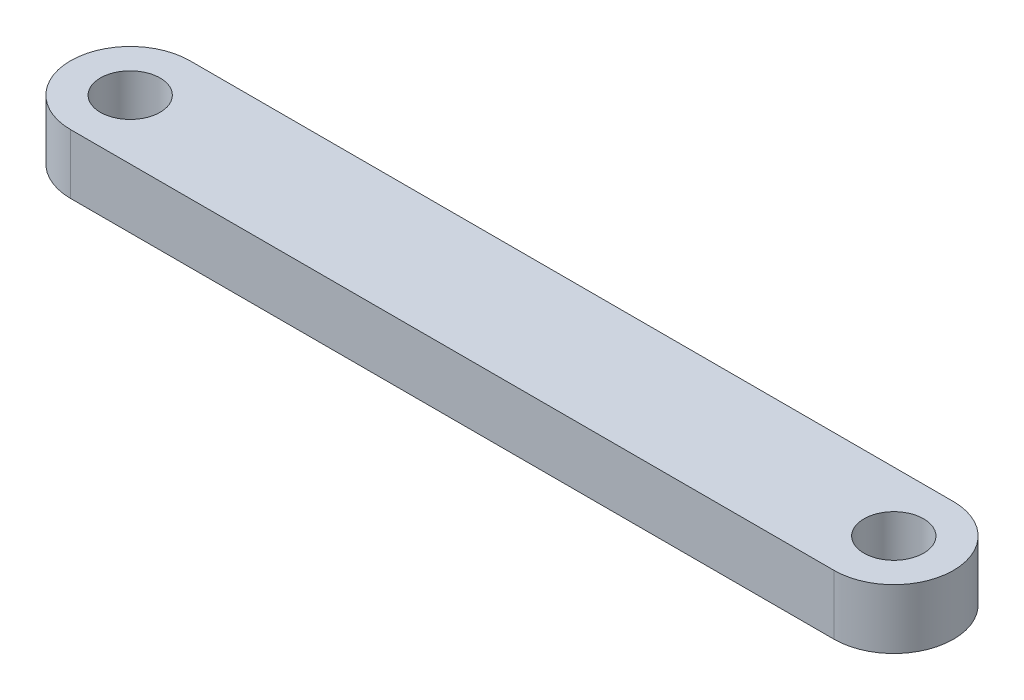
from build123d import *

# Parameters (mm, degrees)
SKETCH1_R           = 50
BOSS_EXTRUDE1_DEPTH = 50


with BuildPart() as part:
    # Sketch1 → Boss-Extrude1 (new, symmetric)
    with BuildSketch(Plane(origin=(0, 0, 0), x_dir=(1, 0, 0), z_dir=(0, 1, 0))):
        with BuildLine():
            Line((-640, 100), (640, 100))
            ThreePointArc((640, 100), (740, 0), (640, -100))
            Line((640, -100), (-640, -100))
            ThreePointArc((-640, -100), (-740, 0), (-640, 100))
        make_face()
        with Locations(Location((-640, 0, 0), (0, 0, 270))):
            Circle(SKETCH1_R, mode=Mode.SUBTRACT)
        with Locations(Location((640, 0, 0), (0, 0, 270))):
            Circle(SKETCH1_R, mode=Mode.SUBTRACT)
    extrude(amount=BOSS_EXTRUDE1_DEPTH, both=True)


solid = part.part
